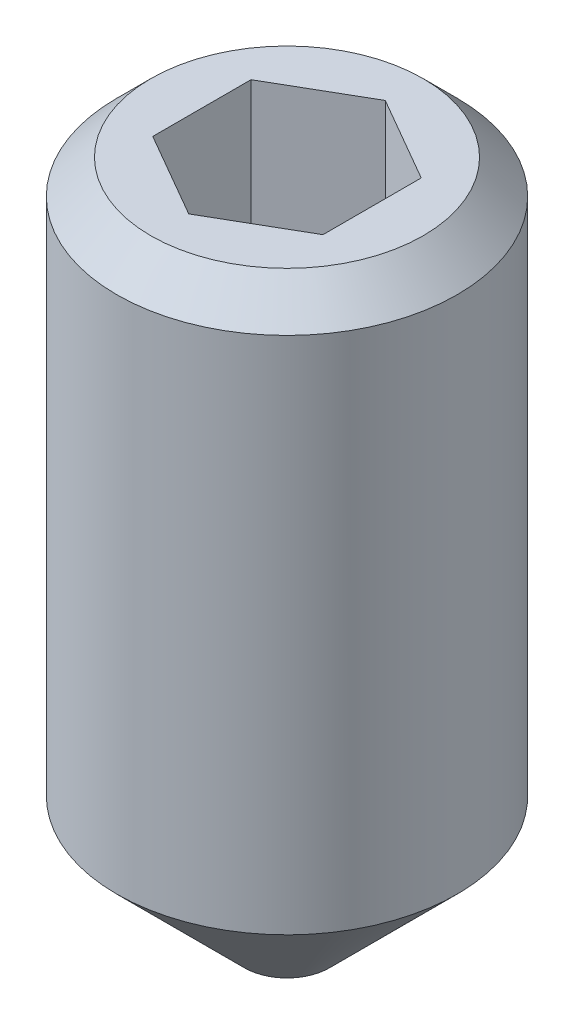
ISO-10303-21;
HEADER;
FILE_DESCRIPTION(('STEP AP214'),'2;1');
FILE_NAME('part.step','',(''),(''),'','','');
FILE_SCHEMA(('AUTOMOTIVE_DESIGN { 1 0 10303 214 1 1 1 1 }'));
ENDSEC;
DATA;
#1=APPLICATION_CONTEXT('core data for automotive mechanical design processes');
#2=APPLICATION_PROTOCOL_DEFINITION('international standard','automotive_design',2000,#1);
#3=PRODUCT_CONTEXT('',#1,'mechanical');
#4=PRODUCT('Part','Part','',(#3));
#5=PRODUCT_RELATED_PRODUCT_CATEGORY('part','',(#4));
#6=PRODUCT_DEFINITION_FORMATION('','',#4);
#7=PRODUCT_DEFINITION_CONTEXT('part definition',#1,'design');
#8=PRODUCT_DEFINITION('design','',#6,#7);
#9=PRODUCT_DEFINITION_SHAPE('','',#8);
#10=(LENGTH_UNIT() NAMED_UNIT(*) SI_UNIT(.MILLI.,.METRE.));
#11=(NAMED_UNIT(*) PLANE_ANGLE_UNIT() SI_UNIT($,.RADIAN.));
#12=(NAMED_UNIT(*) SI_UNIT($,.STERADIAN.) SOLID_ANGLE_UNIT());
#13=UNCERTAINTY_MEASURE_WITH_UNIT(LENGTH_MEASURE(1.E-05),#10,'distance_accuracy_value','');
#14=(GEOMETRIC_REPRESENTATION_CONTEXT(3) GLOBAL_UNCERTAINTY_ASSIGNED_CONTEXT((#13)) GLOBAL_UNIT_ASSIGNED_CONTEXT((#10,
#11,#12)) REPRESENTATION_CONTEXT('',''));
#15=CARTESIAN_POINT('',(0.,0.,0.));
#16=DIRECTION('',(0.,0.,1.));
#17=DIRECTION('',(1.,0.,0.));
#18=AXIS2_PLACEMENT_3D('',#15,#16,#17);
#19=CARTESIAN_POINT('',(0.,-16.,0.));
#20=DIRECTION('',(0.,1.,0.));
#21=DIRECTION('',(0.,0.,1.));
#22=AXIS2_PLACEMENT_3D('',#19,#20,#21);
#23=PLANE('',#22);
#24=CARTESIAN_POINT('',(0.,-16.,0.));
#25=DIRECTION('',(0.,1.,0.));
#26=DIRECTION('',(0.,0.,1.));
#27=AXIS2_PLACEMENT_3D('',#24,#25,#26);
#28=CIRCLE('',#27,1.);
#29=CARTESIAN_POINT('',(0.,-16.,1.));
#30=VERTEX_POINT('',#29);
#31=EDGE_CURVE('E145',#30,#30,#28,.F.);
#32=ORIENTED_EDGE('',*,*,#31,.T.);
#33=EDGE_LOOP('',(#32));
#34=FACE_BOUND('',#33,.T.);
#35=ADVANCED_FACE('F34',(#34),#23,.F.);
#36=CARTESIAN_POINT('',(0.,0.,0.));
#37=DIRECTION('',(0.,1.,0.));
#38=DIRECTION('',(0.,0.,1.));
#39=AXIS2_PLACEMENT_3D('',#36,#37,#38);
#40=CYLINDRICAL_SURFACE('',#39,4.);
#41=CARTESIAN_POINT('',(0.,-0.800000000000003,0.));
#42=DIRECTION('',(0.,-1.,0.));
#43=DIRECTION('',(0.,0.,-1.));
#44=AXIS2_PLACEMENT_3D('',#41,#42,#43);
#45=CIRCLE('',#44,4.);
#46=CARTESIAN_POINT('',(0.,-0.800000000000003,-4.));
#47=VERTEX_POINT('',#46);
#48=EDGE_CURVE('E11',#47,#47,#45,.T.);
#49=ORIENTED_EDGE('',*,*,#48,.T.);
#50=EDGE_LOOP('',(#49));
#51=FACE_BOUND('',#50,.T.);
#52=CARTESIAN_POINT('',(0.,-13.,0.));
#53=DIRECTION('',(0.,1.,0.));
#54=DIRECTION('',(0.,0.,1.));
#55=AXIS2_PLACEMENT_3D('',#52,#53,#54);
#56=CIRCLE('',#55,4.);
#57=CARTESIAN_POINT('',(0.,-13.,4.));
#58=VERTEX_POINT('',#57);
#59=EDGE_CURVE('E136',#58,#58,#56,.T.);
#60=ORIENTED_EDGE('',*,*,#59,.T.);
#61=EDGE_LOOP('',(#60));
#62=FACE_BOUND('',#61,.T.);
#63=ADVANCED_FACE('F166',(#51,#62),#40,.T.);
#64=CARTESIAN_POINT('',(0.,0.,0.));
#65=DIRECTION('',(0.,-1.,0.));
#66=DIRECTION('',(0.,0.,-1.));
#67=AXIS2_PLACEMENT_3D('',#64,#65,#66);
#68=PLANE('',#67);
#69=DIRECTION('',(0.866025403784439,0.,-0.5));
#70=VECTOR('',#69,1.);
#71=CARTESIAN_POINT('',(0.,0.,2.3094010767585));
#72=LINE('',#71,#70);
#73=CARTESIAN_POINT('',(0.,0.,2.3094010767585));
#74=VERTEX_POINT('',#73);
#75=CARTESIAN_POINT('',(2.,0.,1.15470053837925));
#76=VERTEX_POINT('',#75);
#77=EDGE_CURVE('E102',#74,#76,#72,.T.);
#78=ORIENTED_EDGE('',*,*,#77,.F.);
#79=DIRECTION('',(0.866025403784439,0.,0.5));
#80=VECTOR('',#79,1.);
#81=CARTESIAN_POINT('',(-2.,0.,1.15470053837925));
#82=LINE('',#81,#80);
#83=CARTESIAN_POINT('',(-2.,0.,1.15470053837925));
#84=VERTEX_POINT('',#83);
#85=EDGE_CURVE('E48',#84,#74,#82,.T.);
#86=ORIENTED_EDGE('',*,*,#85,.F.);
#87=DIRECTION('',(0.,0.,1.));
#88=VECTOR('',#87,1.);
#89=CARTESIAN_POINT('',(-2.,0.,-1.15470053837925));
#90=LINE('',#89,#88);
#91=CARTESIAN_POINT('',(-2.,0.,-1.15470053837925));
#92=VERTEX_POINT('',#91);
#93=EDGE_CURVE('E118',#92,#84,#90,.T.);
#94=ORIENTED_EDGE('',*,*,#93,.F.);
#95=DIRECTION('',(-0.866025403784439,0.,0.5));
#96=VECTOR('',#95,1.);
#97=CARTESIAN_POINT('',(0.,0.,-2.3094010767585));
#98=LINE('',#97,#96);
#99=CARTESIAN_POINT('',(0.,0.,-2.3094010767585));
#100=VERTEX_POINT('',#99);
#101=EDGE_CURVE('E112',#100,#92,#98,.T.);
#102=ORIENTED_EDGE('',*,*,#101,.F.);
#103=DIRECTION('',(-0.866025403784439,0.,-0.5));
#104=VECTOR('',#103,1.);
#105=CARTESIAN_POINT('',(2.,0.,-1.15470053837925));
#106=LINE('',#105,#104);
#107=CARTESIAN_POINT('',(2.,0.,-1.15470053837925));
#108=VERTEX_POINT('',#107);
#109=EDGE_CURVE('E110',#108,#100,#106,.T.);
#110=ORIENTED_EDGE('',*,*,#109,.F.);
#111=DIRECTION('',(0.,0.,-1.));
#112=VECTOR('',#111,1.);
#113=CARTESIAN_POINT('',(2.,0.,1.15470053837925));
#114=LINE('',#113,#112);
#115=EDGE_CURVE('E91',#76,#108,#114,.T.);
#116=ORIENTED_EDGE('',*,*,#115,.F.);
#117=EDGE_LOOP('',(#78,#86,#94,#102,#110,#116));
#118=FACE_BOUND('',#117,.T.);
#119=CARTESIAN_POINT('',(0.,0.,0.));
#120=DIRECTION('',(0.,-1.,0.));
#121=DIRECTION('',(0.,0.,-1.));
#122=AXIS2_PLACEMENT_3D('',#119,#120,#121);
#123=CIRCLE('',#122,3.2);
#124=CARTESIAN_POINT('',(0.,0.,-3.2));
#125=VERTEX_POINT('',#124);
#126=EDGE_CURVE('E41',#125,#125,#123,.F.);
#127=ORIENTED_EDGE('',*,*,#126,.T.);
#128=EDGE_LOOP('',(#127));
#129=FACE_BOUND('',#128,.T.);
#130=ADVANCED_FACE('F106',(#118,#129),#68,.F.);
#131=CARTESIAN_POINT('',(0.,-13.,0.));
#132=DIRECTION('',(0.,1.,0.));
#133=DIRECTION('',(0.,0.,1.));
#134=AXIS2_PLACEMENT_3D('',#131,#132,#133);
#135=CONICAL_SURFACE('',#134,4.,0.785398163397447);
#136=CARTESIAN_POINT('',(0.,-16.,1.));
#137=CARTESIAN_POINT('',(0.,-15.96875,1.03125));
#138=CARTESIAN_POINT('',(0.,-15.9375,1.0625));
#139=CARTESIAN_POINT('',(0.,-15.875,1.125));
#140=CARTESIAN_POINT('',(0.,-15.84375,1.15625));
#141=CARTESIAN_POINT('',(0.,-15.78125,1.21875));
#142=CARTESIAN_POINT('',(0.,-15.75,1.25));
#143=CARTESIAN_POINT('',(0.,-15.6875,1.3125));
#144=CARTESIAN_POINT('',(0.,-15.65625,1.34375));
#145=CARTESIAN_POINT('',(0.,-15.59375,1.40625));
#146=CARTESIAN_POINT('',(0.,-15.5625,1.4375));
#147=CARTESIAN_POINT('',(0.,-15.5,1.5));
#148=CARTESIAN_POINT('',(0.,-15.46875,1.53125));
#149=CARTESIAN_POINT('',(0.,-15.40625,1.59375));
#150=CARTESIAN_POINT('',(0.,-15.375,1.625));
#151=CARTESIAN_POINT('',(0.,-15.3125,1.6875));
#152=CARTESIAN_POINT('',(0.,-15.28125,1.71875));
#153=CARTESIAN_POINT('',(0.,-15.21875,1.78125));
#154=CARTESIAN_POINT('',(0.,-15.1875,1.8125));
#155=CARTESIAN_POINT('',(0.,-15.125,1.875));
#156=CARTESIAN_POINT('',(0.,-15.09375,1.90625));
#157=CARTESIAN_POINT('',(0.,-15.03125,1.96875));
#158=CARTESIAN_POINT('',(0.,-15.,2.));
#159=CARTESIAN_POINT('',(0.,-14.9375,2.0625));
#160=CARTESIAN_POINT('',(0.,-14.90625,2.09375));
#161=CARTESIAN_POINT('',(0.,-14.84375,2.15625));
#162=CARTESIAN_POINT('',(0.,-14.8125,2.1875));
#163=CARTESIAN_POINT('',(0.,-14.75,2.25));
#164=CARTESIAN_POINT('',(0.,-14.71875,2.28125));
#165=CARTESIAN_POINT('',(0.,-14.65625,2.34375));
#166=CARTESIAN_POINT('',(0.,-14.625,2.375));
#167=CARTESIAN_POINT('',(0.,-14.5625,2.4375));
#168=CARTESIAN_POINT('',(0.,-14.53125,2.46875));
#169=CARTESIAN_POINT('',(0.,-14.46875,2.53125));
#170=CARTESIAN_POINT('',(0.,-14.4375,2.5625));
#171=CARTESIAN_POINT('',(0.,-14.375,2.625));
#172=CARTESIAN_POINT('',(0.,-14.34375,2.65625));
#173=CARTESIAN_POINT('',(0.,-14.28125,2.71875));
#174=CARTESIAN_POINT('',(0.,-14.25,2.75));
#175=CARTESIAN_POINT('',(0.,-14.1875,2.8125));
#176=CARTESIAN_POINT('',(0.,-14.15625,2.84375));
#177=CARTESIAN_POINT('',(0.,-14.09375,2.90625));
#178=CARTESIAN_POINT('',(0.,-14.0625,2.9375));
#179=CARTESIAN_POINT('',(0.,-14.,3.));
#180=CARTESIAN_POINT('',(0.,-13.96875,3.03125));
#181=CARTESIAN_POINT('',(0.,-13.90625,3.09375));
#182=CARTESIAN_POINT('',(0.,-13.875,3.125));
#183=CARTESIAN_POINT('',(0.,-13.8125,3.1875));
#184=CARTESIAN_POINT('',(0.,-13.78125,3.21875));
#185=CARTESIAN_POINT('',(0.,-13.71875,3.28125));
#186=CARTESIAN_POINT('',(0.,-13.6875,3.3125));
#187=CARTESIAN_POINT('',(0.,-13.625,3.375));
#188=CARTESIAN_POINT('',(0.,-13.59375,3.40625));
#189=CARTESIAN_POINT('',(0.,-13.53125,3.46875));
#190=CARTESIAN_POINT('',(0.,-13.5,3.5));
#191=CARTESIAN_POINT('',(0.,-13.4375,3.5625));
#192=CARTESIAN_POINT('',(0.,-13.40625,3.59375));
#193=CARTESIAN_POINT('',(0.,-13.34375,3.65625));
#194=CARTESIAN_POINT('',(0.,-13.3125,3.6875));
#195=CARTESIAN_POINT('',(0.,-13.25,3.75));
#196=CARTESIAN_POINT('',(0.,-13.21875,3.78125));
#197=CARTESIAN_POINT('',(0.,-13.15625,3.84375));
#198=CARTESIAN_POINT('',(0.,-13.125,3.875));
#199=CARTESIAN_POINT('',(0.,-13.0625,3.9375));
#200=CARTESIAN_POINT('',(0.,-13.03125,3.96875));
#201=CARTESIAN_POINT('',(0.,-13.,4.));
#202=B_SPLINE_CURVE_WITH_KNOTS('',3,(#136,#137,#138,#139,#140,#141,#142,#143,#144,#145,#146,
#147,#148,#149,#150,#151,#152,#153,#154,#155,#156,#157,#158,#159,#160,#161,#162,#163,#164,#165,
#166,#167,#168,#169,#170,#171,#172,#173,#174,#175,#176,#177,#178,#179,#180,#181,#182,#183,#184,
#185,#186,#187,#188,#189,#190,#191,#192,#193,#194,#195,#196,#197,#198,#199,#200,#201),
.UNSPECIFIED.,.F.,.F.,(4,2,2,2,2,2,2,2,2,2,2,2,2,2,2,2,2,2,2,2,2,2,2,2,2,2,2,2,2,2,2,2,4),(0.,
0.132582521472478,0.265165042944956,0.397747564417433,0.530330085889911,0.662912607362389,
0.795495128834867,0.928077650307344,1.06066017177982,1.1932426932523,1.32582521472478,
1.45840773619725,1.59099025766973,1.72357277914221,1.85615530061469,1.98873782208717,
2.12132034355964,2.25390286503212,2.3864853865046,2.51906790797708,2.65165042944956,
2.78423295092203,2.91681547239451,3.04939799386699,3.18198051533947,3.31456303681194,
3.44714555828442,3.5797280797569,3.71231060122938,3.84489312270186,3.97747564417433,
4.11005816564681,4.24264068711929),.UNSPECIFIED.);
#203=EDGE_CURVE('BSEAM153',#30,#58,#202,.T.);
#204=ORIENTED_EDGE('',*,*,#31,.F.);
#205=ORIENTED_EDGE('',*,*,#59,.F.);
#206=ORIENTED_EDGE('',*,*,#203,.T.);
#207=ORIENTED_EDGE('',*,*,#203,.F.);
#208=EDGE_LOOP('',(#204,#206,#205,#207));
#209=FACE_BOUND('',#208,.T.);
#210=ADVANCED_FACE('F153',(#209),#135,.T.);
#211=CARTESIAN_POINT('',(0.,0.,0.));
#212=DIRECTION('',(0.,-1.,0.));
#213=DIRECTION('',(0.,0.,-1.));
#214=AXIS2_PLACEMENT_3D('',#211,#212,#213);
#215=CONICAL_SURFACE('',#214,3.2,0.785398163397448);
#216=CARTESIAN_POINT('',(0.,-0.800000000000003,-4.));
#217=CARTESIAN_POINT('',(0.,-0.791666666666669,-3.99166666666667));
#218=CARTESIAN_POINT('',(0.,-0.783333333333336,-3.98333333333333));
#219=CARTESIAN_POINT('',(0.,-0.766666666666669,-3.96666666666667));
#220=CARTESIAN_POINT('',(0.,-0.758333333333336,-3.95833333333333));
#221=CARTESIAN_POINT('',(0.,-0.741666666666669,-3.94166666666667));
#222=CARTESIAN_POINT('',(0.,-0.733333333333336,-3.93333333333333));
#223=CARTESIAN_POINT('',(0.,-0.716666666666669,-3.91666666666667));
#224=CARTESIAN_POINT('',(0.,-0.708333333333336,-3.90833333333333));
#225=CARTESIAN_POINT('',(0.,-0.691666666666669,-3.89166666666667));
#226=CARTESIAN_POINT('',(0.,-0.683333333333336,-3.88333333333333));
#227=CARTESIAN_POINT('',(0.,-0.666666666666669,-3.86666666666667));
#228=CARTESIAN_POINT('',(0.,-0.658333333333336,-3.85833333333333));
#229=CARTESIAN_POINT('',(0.,-0.641666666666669,-3.84166666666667));
#230=CARTESIAN_POINT('',(0.,-0.633333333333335,-3.83333333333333));
#231=CARTESIAN_POINT('',(0.,-0.616666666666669,-3.81666666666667));
#232=CARTESIAN_POINT('',(0.,-0.608333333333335,-3.80833333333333));
#233=CARTESIAN_POINT('',(0.,-0.591666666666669,-3.79166666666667));
#234=CARTESIAN_POINT('',(0.,-0.583333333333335,-3.78333333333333));
#235=CARTESIAN_POINT('',(0.,-0.566666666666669,-3.76666666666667));
#236=CARTESIAN_POINT('',(0.,-0.558333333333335,-3.75833333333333));
#237=CARTESIAN_POINT('',(0.,-0.541666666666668,-3.74166666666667));
#238=CARTESIAN_POINT('',(0.,-0.533333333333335,-3.73333333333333));
#239=CARTESIAN_POINT('',(0.,-0.516666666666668,-3.71666666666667));
#240=CARTESIAN_POINT('',(0.,-0.508333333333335,-3.70833333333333));
#241=CARTESIAN_POINT('',(0.,-0.491666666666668,-3.69166666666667));
#242=CARTESIAN_POINT('',(0.,-0.483333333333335,-3.68333333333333));
#243=CARTESIAN_POINT('',(0.,-0.466666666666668,-3.66666666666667));
#244=CARTESIAN_POINT('',(0.,-0.458333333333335,-3.65833333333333));
#245=CARTESIAN_POINT('',(0.,-0.441666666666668,-3.64166666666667));
#246=CARTESIAN_POINT('',(0.,-0.433333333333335,-3.63333333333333));
#247=CARTESIAN_POINT('',(0.,-0.416666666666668,-3.61666666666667));
#248=CARTESIAN_POINT('',(0.,-0.408333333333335,-3.60833333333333));
#249=CARTESIAN_POINT('',(0.,-0.391666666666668,-3.59166666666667));
#250=CARTESIAN_POINT('',(0.,-0.383333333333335,-3.58333333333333));
#251=CARTESIAN_POINT('',(0.,-0.366666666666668,-3.56666666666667));
#252=CARTESIAN_POINT('',(0.,-0.358333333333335,-3.55833333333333));
#253=CARTESIAN_POINT('',(0.,-0.341666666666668,-3.54166666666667));
#254=CARTESIAN_POINT('',(0.,-0.333333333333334,-3.53333333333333));
#255=CARTESIAN_POINT('',(0.,-0.316666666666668,-3.51666666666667));
#256=CARTESIAN_POINT('',(0.,-0.308333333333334,-3.50833333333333));
#257=CARTESIAN_POINT('',(0.,-0.291666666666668,-3.49166666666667));
#258=CARTESIAN_POINT('',(0.,-0.283333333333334,-3.48333333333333));
#259=CARTESIAN_POINT('',(0.,-0.266666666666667,-3.46666666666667));
#260=CARTESIAN_POINT('',(0.,-0.258333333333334,-3.45833333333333));
#261=CARTESIAN_POINT('',(0.,-0.241666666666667,-3.44166666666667));
#262=CARTESIAN_POINT('',(0.,-0.233333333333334,-3.43333333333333));
#263=CARTESIAN_POINT('',(0.,-0.216666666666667,-3.41666666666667));
#264=CARTESIAN_POINT('',(0.,-0.208333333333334,-3.40833333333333));
#265=CARTESIAN_POINT('',(0.,-0.191666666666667,-3.39166666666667));
#266=CARTESIAN_POINT('',(0.,-0.183333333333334,-3.38333333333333));
#267=CARTESIAN_POINT('',(0.,-0.166666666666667,-3.36666666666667));
#268=CARTESIAN_POINT('',(0.,-0.158333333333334,-3.35833333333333));
#269=CARTESIAN_POINT('',(0.,-0.141666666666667,-3.34166666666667));
#270=CARTESIAN_POINT('',(0.,-0.133333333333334,-3.33333333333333));
#271=CARTESIAN_POINT('',(0.,-0.116666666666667,-3.31666666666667));
#272=CARTESIAN_POINT('',(0.,-0.108333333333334,-3.30833333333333));
#273=CARTESIAN_POINT('',(0.,-0.091666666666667,-3.29166666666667));
#274=CARTESIAN_POINT('',(0.,-0.0833333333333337,-3.28333333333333));
#275=CARTESIAN_POINT('',(0.,-0.0666666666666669,-3.26666666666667));
#276=CARTESIAN_POINT('',(0.,-0.0583333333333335,-3.25833333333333));
#277=CARTESIAN_POINT('',(0.,-0.0416666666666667,-3.24166666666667));
#278=CARTESIAN_POINT('',(0.,-0.0333333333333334,-3.23333333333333));
#279=CARTESIAN_POINT('',(0.,-0.0166666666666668,-3.21666666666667));
#280=CARTESIAN_POINT('',(0.,-0.00833333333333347,-3.20833333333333));
#281=CARTESIAN_POINT('',(0.,0.,-3.2));
#282=B_SPLINE_CURVE_WITH_KNOTS('',3,(#216,#217,#218,#219,#220,#221,#222,#223,#224,#225,#226,
#227,#228,#229,#230,#231,#232,#233,#234,#235,#236,#237,#238,#239,#240,#241,#242,#243,#244,#245,
#246,#247,#248,#249,#250,#251,#252,#253,#254,#255,#256,#257,#258,#259,#260,#261,#262,#263,#264,
#265,#266,#267,#268,#269,#270,#271,#272,#273,#274,#275,#276,#277,#278,#279,#280,#281),
.UNSPECIFIED.,.F.,.F.,(4,2,2,2,2,2,2,2,2,2,2,2,2,2,2,2,2,2,2,2,2,2,2,2,2,2,2,2,2,2,2,2,4),(0.,
0.0353553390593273,0.0707106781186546,0.106066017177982,0.14142135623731,0.176776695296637,
0.212132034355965,0.247487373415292,0.28284271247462,0.318198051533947,0.353553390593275,
0.388908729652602,0.424264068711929,0.459619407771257,0.494974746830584,0.530330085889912,
0.565685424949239,0.601040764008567,0.636396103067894,0.671751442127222,0.707106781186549,
0.742462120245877,0.777817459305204,0.813172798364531,0.848528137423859,0.883883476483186,
0.919238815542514,0.954594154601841,0.989949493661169,1.0253048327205,1.06066017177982,
1.09601551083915,1.13137084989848),.UNSPECIFIED.);
#283=EDGE_CURVE('BSEAM150',#47,#125,#282,.T.);
#284=ORIENTED_EDGE('',*,*,#48,.F.);
#285=ORIENTED_EDGE('',*,*,#126,.F.);
#286=ORIENTED_EDGE('',*,*,#283,.T.);
#287=ORIENTED_EDGE('',*,*,#283,.F.);
#288=EDGE_LOOP('',(#284,#286,#285,#287));
#289=FACE_BOUND('',#288,.T.);
#290=ADVANCED_FACE('F150',(#289),#215,.T.);
#291=CARTESIAN_POINT('',(-2.,-5.,1.15470053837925));
#292=DIRECTION('',(-0.5,0.,0.866025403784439));
#293=DIRECTION('',(0.866025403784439,0.,0.5));
#294=AXIS2_PLACEMENT_3D('',#291,#292,#293);
#295=PLANE('',#294);
#296=ORIENTED_EDGE('',*,*,#85,.T.);
#297=DIRECTION('',(0.,1.,0.));
#298=VECTOR('',#297,1.);
#299=CARTESIAN_POINT('',(0.,-5.,2.3094010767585));
#300=LINE('',#299,#298);
#301=CARTESIAN_POINT('',(0.,-5.,2.3094010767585));
#302=VERTEX_POINT('',#301);
#303=EDGE_CURVE('E99',#302,#74,#300,.T.);
#304=ORIENTED_EDGE('',*,*,#303,.F.);
#305=DIRECTION('',(0.866025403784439,0.,0.5));
#306=VECTOR('',#305,1.);
#307=CARTESIAN_POINT('',(-2.,-5.,1.15470053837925));
#308=LINE('',#307,#306);
#309=CARTESIAN_POINT('',(-2.,-5.,1.15470053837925));
#310=VERTEX_POINT('',#309);
#311=EDGE_CURVE('E120',#310,#302,#308,.T.);
#312=ORIENTED_EDGE('',*,*,#311,.F.);
#313=DIRECTION('',(0.,1.,0.));
#314=VECTOR('',#313,1.);
#315=CARTESIAN_POINT('',(-2.,-5.,1.15470053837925));
#316=LINE('',#315,#314);
#317=EDGE_CURVE('E55',#310,#84,#316,.T.);
#318=ORIENTED_EDGE('',*,*,#317,.T.);
#319=EDGE_LOOP('',(#296,#304,#312,#318));
#320=FACE_BOUND('',#319,.T.);
#321=ADVANCED_FACE('F152',(#320),#295,.F.);
#322=CARTESIAN_POINT('',(-2.,-5.,-1.15470053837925));
#323=DIRECTION('',(-1.,0.,0.));
#324=DIRECTION('',(0.,0.,1.));
#325=AXIS2_PLACEMENT_3D('',#322,#323,#324);
#326=PLANE('',#325);
#327=ORIENTED_EDGE('',*,*,#93,.T.);
#328=ORIENTED_EDGE('',*,*,#317,.F.);
#329=DIRECTION('',(0.,0.,1.));
#330=VECTOR('',#329,1.);
#331=CARTESIAN_POINT('',(-2.,-5.,-1.15470053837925));
#332=LINE('',#331,#330);
#333=CARTESIAN_POINT('',(-2.,-5.,-1.15470053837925));
#334=VERTEX_POINT('',#333);
#335=EDGE_CURVE('E132',#334,#310,#332,.T.);
#336=ORIENTED_EDGE('',*,*,#335,.F.);
#337=DIRECTION('',(0.,1.,0.));
#338=VECTOR('',#337,1.);
#339=CARTESIAN_POINT('',(-2.,-5.,-1.15470053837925));
#340=LINE('',#339,#338);
#341=EDGE_CURVE('E137',#334,#92,#340,.T.);
#342=ORIENTED_EDGE('',*,*,#341,.T.);
#343=EDGE_LOOP('',(#327,#328,#336,#342));
#344=FACE_BOUND('',#343,.T.);
#345=ADVANCED_FACE('F160',(#344),#326,.F.);
#346=CARTESIAN_POINT('',(0.,-5.,-2.3094010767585));
#347=DIRECTION('',(-0.5,0.,-0.866025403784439));
#348=DIRECTION('',(-0.866025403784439,0.,0.5));
#349=AXIS2_PLACEMENT_3D('',#346,#347,#348);
#350=PLANE('',#349);
#351=ORIENTED_EDGE('',*,*,#101,.T.);
#352=ORIENTED_EDGE('',*,*,#341,.F.);
#353=DIRECTION('',(-0.866025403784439,0.,0.5));
#354=VECTOR('',#353,1.);
#355=CARTESIAN_POINT('',(0.,-5.,-2.3094010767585));
#356=LINE('',#355,#354);
#357=CARTESIAN_POINT('',(0.,-5.,-2.3094010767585));
#358=VERTEX_POINT('',#357);
#359=EDGE_CURVE('E129',#358,#334,#356,.T.);
#360=ORIENTED_EDGE('',*,*,#359,.F.);
#361=DIRECTION('',(0.,1.,0.));
#362=VECTOR('',#361,1.);
#363=CARTESIAN_POINT('',(0.,-5.,-2.3094010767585));
#364=LINE('',#363,#362);
#365=EDGE_CURVE('E139',#358,#100,#364,.T.);
#366=ORIENTED_EDGE('',*,*,#365,.T.);
#367=EDGE_LOOP('',(#351,#352,#360,#366));
#368=FACE_BOUND('',#367,.T.);
#369=ADVANCED_FACE('F211',(#368),#350,.F.);
#370=CARTESIAN_POINT('',(2.,-5.,-1.15470053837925));
#371=DIRECTION('',(0.5,0.,-0.866025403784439));
#372=DIRECTION('',(-0.866025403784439,0.,-0.5));
#373=AXIS2_PLACEMENT_3D('',#370,#371,#372);
#374=PLANE('',#373);
#375=ORIENTED_EDGE('',*,*,#109,.T.);
#376=ORIENTED_EDGE('',*,*,#365,.F.);
#377=DIRECTION('',(-0.866025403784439,0.,-0.5));
#378=VECTOR('',#377,1.);
#379=CARTESIAN_POINT('',(2.,-5.,-1.15470053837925));
#380=LINE('',#379,#378);
#381=CARTESIAN_POINT('',(2.,-5.,-1.15470053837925));
#382=VERTEX_POINT('',#381);
#383=EDGE_CURVE('E126',#382,#358,#380,.T.);
#384=ORIENTED_EDGE('',*,*,#383,.F.);
#385=DIRECTION('',(0.,1.,0.));
#386=VECTOR('',#385,1.);
#387=CARTESIAN_POINT('',(2.,-5.,-1.15470053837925));
#388=LINE('',#387,#386);
#389=EDGE_CURVE('E98',#382,#108,#388,.T.);
#390=ORIENTED_EDGE('',*,*,#389,.T.);
#391=EDGE_LOOP('',(#375,#376,#384,#390));
#392=FACE_BOUND('',#391,.T.);
#393=ADVANCED_FACE('F219',(#392),#374,.F.);
#394=CARTESIAN_POINT('',(2.,-5.,1.15470053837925));
#395=DIRECTION('',(1.,0.,0.));
#396=DIRECTION('',(0.,0.,-1.));
#397=AXIS2_PLACEMENT_3D('',#394,#395,#396);
#398=PLANE('',#397);
#399=ORIENTED_EDGE('',*,*,#115,.T.);
#400=ORIENTED_EDGE('',*,*,#389,.F.);
#401=DIRECTION('',(0.,0.,-1.));
#402=VECTOR('',#401,1.);
#403=CARTESIAN_POINT('',(2.,-5.,1.15470053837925));
#404=LINE('',#403,#402);
#405=CARTESIAN_POINT('',(2.,-5.,1.15470053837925));
#406=VERTEX_POINT('',#405);
#407=EDGE_CURVE('E94',#406,#382,#404,.T.);
#408=ORIENTED_EDGE('',*,*,#407,.F.);
#409=DIRECTION('',(0.,1.,0.));
#410=VECTOR('',#409,1.);
#411=CARTESIAN_POINT('',(2.,-5.,1.15470053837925));
#412=LINE('',#411,#410);
#413=EDGE_CURVE('E87',#406,#76,#412,.T.);
#414=ORIENTED_EDGE('',*,*,#413,.T.);
#415=EDGE_LOOP('',(#399,#400,#408,#414));
#416=FACE_BOUND('',#415,.T.);
#417=ADVANCED_FACE('F89',(#416),#398,.F.);
#418=CARTESIAN_POINT('',(0.,-5.,2.3094010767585));
#419=DIRECTION('',(0.5,0.,0.866025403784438));
#420=DIRECTION('',(0.866025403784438,0.,-0.5));
#421=AXIS2_PLACEMENT_3D('',#418,#419,#420);
#422=PLANE('',#421);
#423=ORIENTED_EDGE('',*,*,#77,.T.);
#424=ORIENTED_EDGE('',*,*,#413,.F.);
#425=DIRECTION('',(0.866025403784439,0.,-0.5));
#426=VECTOR('',#425,1.);
#427=CARTESIAN_POINT('',(0.,-5.,2.3094010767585));
#428=LINE('',#427,#426);
#429=EDGE_CURVE('E123',#302,#406,#428,.T.);
#430=ORIENTED_EDGE('',*,*,#429,.F.);
#431=ORIENTED_EDGE('',*,*,#303,.T.);
#432=EDGE_LOOP('',(#423,#424,#430,#431));
#433=FACE_BOUND('',#432,.T.);
#434=ADVANCED_FACE('F103',(#433),#422,.F.);
#435=CARTESIAN_POINT('',(-2.,-5.,1.15470053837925));
#436=DIRECTION('',(0.,-1.,0.));
#437=DIRECTION('',(0.,0.,-1.));
#438=AXIS2_PLACEMENT_3D('',#435,#436,#437);
#439=PLANE('',#438);
#440=ORIENTED_EDGE('',*,*,#311,.T.);
#441=ORIENTED_EDGE('',*,*,#429,.T.);
#442=ORIENTED_EDGE('',*,*,#407,.T.);
#443=ORIENTED_EDGE('',*,*,#383,.T.);
#444=ORIENTED_EDGE('',*,*,#359,.T.);
#445=ORIENTED_EDGE('',*,*,#335,.T.);
#446=EDGE_LOOP('',(#440,#441,#442,#443,#444,#445));
#447=FACE_BOUND('',#446,.T.);
#448=ADVANCED_FACE('F243',(#447),#439,.F.);
#449=CLOSED_SHELL('',(#35,#63,#130,#210,#290,#321,#345,#369,#393,#417,#434,#448));
#450=MANIFOLD_SOLID_BREP('B2',#449);
#451=ADVANCED_BREP_SHAPE_REPRESENTATION('',(#18,#450),#14);
#452=SHAPE_DEFINITION_REPRESENTATION(#9,#451);
ENDSEC;
END-ISO-10303-21;
